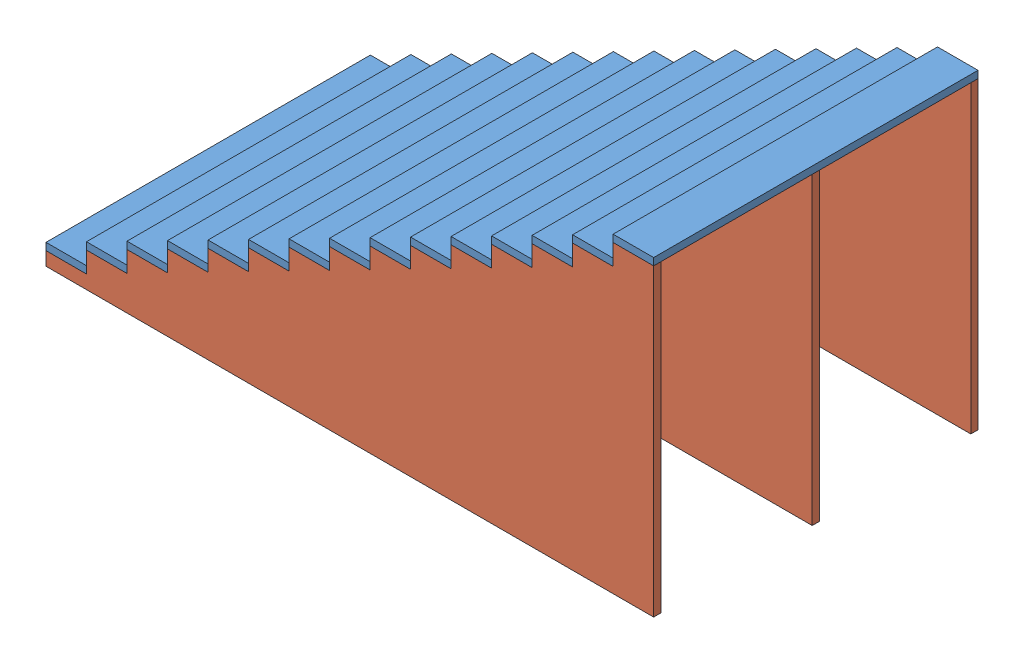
SolidWorks assembly Stair Assembly.SLDASM, configuration Default (file format 15000). Lengths in mm.
Overall size (1070.61 548.64 571.5).
18 component instances, 2 part files, 52 mates.
Components (placement in the parent):
- Stair Step-1: Stair Step.SLDPRT [Default] at (174.3811 150.6598 375.7953) x (0 0 -1) z (0 -1 0) size (571.5 71.37 12.7)
- Stair Support-1: Stair Support.SLDPRT [Default] at (281.4421 -361.4042 90.0453) size (1070.61 535.94 12.7)
- Stair Support-2: Stair Support.SLDPRT [Default] at (281.4421 -361.4042 648.8453) size (1070.61 535.94 12.7)
- Stair Step-2: Stair Step.SLDPRT [Default] at (245.7551 187.2358 375.7953) x (0 0 -1) z (0 -1 0) size (571.5 71.37 12.7)
- Stair Support-3: Stair Support.SLDPRT [Default] at (281.4421 -361.4042 369.4453) size (1070.61 535.94 12.7)
- Stair Step-3: Stair Step.SLDPRT [Default] at (103.0071 114.0838 375.7953) x (0 0 1) z (0 -1 0) size (571.5 71.37 12.7)
- Stair Step-4: Stair Step.SLDPRT [Default] at (31.6331 64.8078 375.7953) x (0 0 -1) z (0 1 0) size (571.5 71.37 12.7)
- Stair Step-5: Stair Step.SLDPRT [Default] at (-539.3589 -227.8002 375.7953) x (0 0 1) z (0 1 0) size (571.5 71.37 12.7)
- Stair Step-6: Stair Step.SLDPRT [Default] at (-111.1149 4.3558 375.7953) x (0 0 -1) z (0 -1 0) size (571.5 71.37 12.7)
- Stair Step-7: Stair Step.SLDPRT [Default] at (-182.4889 -32.2202 375.7953) x (0 0 1) z (0 -1 0) size (571.5 71.37 12.7)
- Stair Step-8: Stair Step.SLDPRT [Default] at (-253.8629 -81.4962 375.7953) x (0 0 1) z (0 1 0) size (571.5 71.37 12.7)
- Stair Step-9: Stair Step.SLDPRT [Default] at (-467.9849 -191.2242 375.7953) x (0 0 1) z (0 1 0) size (571.5 71.37 12.7)
- Stair Step-10: Stair Step.SLDPRT [Default] at (-753.4809 -337.5282 375.7953) x (0 0 1) z (0 1 0) size (571.5 71.37 12.7)
- Stair Step-11: Stair Step.SLDPRT [Default] at (-682.1069 -300.9522 375.7953) x (0 0 -1) z (0 1 0) size (571.5 71.37 12.7)
- Stair Step-12: Stair Step.SLDPRT [Default] at (-610.7329 -264.3762 375.7953) x (0 0 1) z (0 1 0) size (571.5 71.37 12.7)
- Stair Step-13: Stair Step.SLDPRT [Default] at (-396.6109 -154.6482 375.7953) x (0 0 1) z (0 1 0) size (571.5 71.37 12.7)
- Stair Step-14: Stair Step.SLDPRT [Default] at (-325.2369 -118.0722 375.7953) x (0 0 1) z (0 1 0) size (571.5 71.37 12.7)
- Stair Step-15: Stair Step.SLDPRT [Default] at (-39.7409 28.2318 375.7953) x (0 0 -1) z (0 1 0) size (571.5 71.37 12.7)
Mates (geometry in assembly coordinates):
- Coincident1: coincident anti-aligned: plane of Stair Step-1 through (174.3811 137.9598 375.7953) normal (0 -1 0); plane of Stair Support-1 through (281.4421 137.9598 102.7453) normal (0 1 0)
- Coincident2: coincident anti-aligned: plane of Stair Step-1 through (210.0681 137.9598 90.0453) normal (1 0 0); plane of Stair Support-1 through (210.0681 -361.4042 102.7453) normal (-1 0 0)
- Coincident3: coincident aligned: plane of Stair Step-1 through (210.0681 137.9598 90.0453) normal (0 0 -1); plane of Stair Support-1 through (281.4421 -361.4042 90.0453) normal (0 0 -1)
- Coincident4: coincident anti-aligned: plane of Stair Step-1 through (174.3811 137.9598 375.7953) normal (0 -1 0); plane of Stair Support-2 through (281.4421 137.9598 661.5453) normal (0 1 0)
- Coincident5: coincident anti-aligned: plane of Stair Step-1 through (210.0681 137.9598 90.0453) normal (1 0 0); plane of Stair Support-2 through (210.0681 -361.4042 661.5453) normal (-1 0 0)
- Coincident6: coincident aligned: plane of Stair Step-1 through (210.0681 137.9598 661.5453) normal (0 0 1); plane of Stair Support-2 through (281.4421 -361.4042 661.5453) normal (0 0 1)
- Coincident7: coincident anti-aligned: plane of Stair Support-1 through (281.4421 174.5358 102.7453) normal (0 1 0); plane of Stair Step-2 through (245.7551 174.5358 375.7953) normal (0 -1 0)
- Coincident8: coincident: plane of Stair Support-2 through (281.4421 -361.4042 661.5453) normal (0 0 1); line of Stair Step-2 through (281.4421 187.2358 661.5453) axis (-1 0 0)
- Coincident9: coincident aligned: plane of Stair Support-2 through (281.4421 -361.4042 661.5453) normal (1 0 0); plane of Stair Step-2 through (281.4421 174.5358 90.0453) normal (1 0 0)
- Coincident10: coincident: plane of Stair Step-1 through (174.3811 137.9598 375.7953) normal (0 -1 0); plane of Stair Support-3 through (281.4421 137.9598 380.3604) normal (0 1 0)
- Coincident11: coincident: plane of Stair Step-1 through (210.0681 137.9598 90.0453) normal (1 0 0); plane of Stair Support-3 through (210.0681 -361.4042 380.3604) normal (-1 0 0)
- Parallel2: parallel anti-aligned: plane of Stair Step-1 through (174.3811 150.6598 375.7953) normal (0 1 0); plane of Stair Step-3 through (103.0071 101.3838 375.7953) normal (0 -1 0)
- Coincident14: coincident aligned: plane of Stair Step-1 through (210.0681 137.9598 90.0453) normal (0 0 -1); plane of Stair Step-3 through (67.3201 101.3838 90.0453) normal (0 0 -1)
- Coincident16: coincident anti-aligned: plane of Stair Support-1 through (138.6941 -361.4042 102.7453) normal (-1 0 0); plane of Stair Step-3 through (138.6941 101.3838 661.5453) normal (1 0 0)
- Coincident17: coincident: line of Stair Support-1 through (138.6941 101.3838 90.0453) axis (-1 0 0); plane of Stair Step-3 through (103.0071 101.3838 375.7953) normal (0 -1 0)
- Coincident18: coincident anti-aligned: plane of Stair Support-1 through (281.4421 64.8078 102.7453) normal (0 1 0); plane of Stair Step-4 through (31.6331 64.8078 375.7953) normal (0 -1 0)
- Coincident19: coincident: plane of Stair Support-3 through (67.3201 -361.4042 380.3604) normal (-1 0 0); plane of Stair Step-4 through (67.3201 77.5078 90.0453) normal (1 0 0)
- Coincident20: coincident aligned: plane of Stair Support-2 through (281.4421 -361.4042 661.5453) normal (0 0 1); plane of Stair Step-4 through (-4.0539 77.5078 661.5453) normal (0 0 1)
- Coincident21: coincident anti-aligned: plane of Stair Support-1 through (281.4421 28.2318 102.7453) normal (0 1 0); plane of Stair Step-15 through (-39.7409 28.2318 375.7953) normal (0 -1 0)
- Coincident22: coincident anti-aligned: plane of Stair Support-2 through (-4.0539 -361.4042 661.5453) normal (-1 0 0); plane of Stair Step-15 through (-4.0539 40.9318 90.0453) normal (1 0 0)
- Coincident23: coincident aligned: plane of Stair Support-2 through (281.4421 -361.4042 661.5453) normal (0 0 1); plane of Stair Step-15 through (-75.4279 40.9318 661.5453) normal (0 0 1)
- Coincident24: coincident: plane of Stair Support-3 through (281.4421 -8.3442 380.3604) normal (0 1 0); plane of Stair Step-6 through (-111.1149 -8.3442 375.7953) normal (0 -1 0)
- Coincident26: coincident aligned: plane of Stair Support-2 through (281.4421 -361.4042 661.5453) normal (0 0 1); plane of Stair Step-6 through (-75.4279 -8.3442 661.5453) normal (0 0 1)
- Coincident27: coincident anti-aligned: plane of Stair Support-2 through (-75.4279 -361.4042 661.5453) normal (-1 0 0); plane of Stair Step-6 through (-75.4279 -8.3442 90.0453) normal (1 0 0)
- Coincident28: coincident anti-aligned: plane of Stair Support-1 through (281.4421 -44.9202 102.7453) normal (0 1 0); plane of Stair Step-7 through (-182.4889 -44.9202 375.7953) normal (0 -1 0)
- Coincident29: coincident aligned: plane of Stair Support-1 through (281.4421 -361.4042 90.0453) normal (0 0 -1); plane of Stair Step-7 through (-218.1759 -44.9202 90.0453) normal (0 0 -1)
- Coincident30: coincident anti-aligned: plane of Stair Support-1 through (-146.8019 -361.4042 102.7453) normal (-1 0 0); plane of Stair Step-7 through (-146.8019 -44.9202 661.5453) normal (1 0 0)
- Coincident31: coincident anti-aligned: plane of Stair Support-1 through (281.4421 -81.4962 102.7453) normal (0 1 0); plane of Stair Step-8 through (-253.8629 -81.4962 375.7953) normal (0 -1 0)
- Coincident32: coincident aligned: plane of Stair Support-1 through (281.4421 -361.4042 90.0453) normal (0 0 -1); plane of Stair Step-8 through (-218.1759 -68.7962 90.0453) normal (0 0 -1)
- Coincident33: coincident anti-aligned: plane of Stair Support-1 through (-218.1759 -361.4042 102.7453) normal (-1 0 0); plane of Stair Step-8 through (-218.1759 -68.7962 661.5453) normal (1 0 0)
- Coincident36: coincident anti-aligned: plane of Stair Support-1 through (281.4421 -118.0722 102.7453) normal (0 1 0); plane of Stair Step-14 through (-325.2369 -118.0722 375.7953) normal (0 -1 0)
- Coincident38: coincident aligned: plane of Stair Support-1 through (281.4421 -361.4042 90.0453) normal (0 0 -1); plane of Stair Step-14 through (-289.5499 -105.3722 90.0453) normal (0 0 -1)
- Coincident39: coincident anti-aligned: plane of Stair Support-1 through (-289.5499 -361.4042 102.7453) normal (-1 0 0); plane of Stair Step-14 through (-289.5499 -105.3722 661.5453) normal (1 0 0)
- Coincident40: coincident anti-aligned: plane of Stair Support-1 through (281.4421 -154.6482 102.7453) normal (0 1 0); plane of Stair Step-13 through (-396.6109 -154.6482 375.7953) normal (0 -1 0)
- Coincident41: coincident aligned: plane of Stair Support-1 through (281.4421 -361.4042 90.0453) normal (0 0 -1); plane of Stair Step-13 through (-360.9239 -141.9482 90.0453) normal (0 0 -1)
- Coincident42: coincident anti-aligned: plane of Stair Support-1 through (-360.9239 -361.4042 102.7453) normal (-1 0 0); plane of Stair Step-13 through (-360.9239 -141.9482 661.5453) normal (1 0 0)
- Coincident43: coincident anti-aligned: plane of Stair Support-1 through (281.4421 -191.2242 102.7453) normal (0 1 0); plane of Stair Step-9 through (-467.9849 -191.2242 375.7953) normal (0 -1 0)
- Coincident44: coincident aligned: plane of Stair Support-1 through (281.4421 -361.4042 90.0453) normal (0 0 -1); plane of Stair Step-9 through (-432.2979 -178.5242 90.0453) normal (0 0 -1)
- Coincident45: coincident anti-aligned: plane of Stair Support-1 through (-432.2979 -361.4042 102.7453) normal (-1 0 0); plane of Stair Step-9 through (-432.2979 -178.5242 661.5453) normal (1 0 0)
- Coincident46: coincident anti-aligned: plane of Stair Support-1 through (281.4421 -227.8002 102.7453) normal (0 1 0); plane of Stair Step-5 through (-539.3589 -227.8002 375.7953) normal (0 -1 0)
- Coincident47: coincident aligned: plane of Stair Support-1 through (281.4421 -361.4042 90.0453) normal (0 0 -1); plane of Stair Step-5 through (-503.6719 -215.1002 90.0453) normal (0 0 -1)
- Coincident48: coincident: plane of Stair Support-1 through (-503.6719 -361.4042 102.7453) normal (-1 0 0); line of Stair Step-5 through (-503.6719 -215.1002 661.5453) axis (0 0 -1)
- Coincident49: coincident anti-aligned: plane of Stair Support-1 through (281.4421 -264.3762 102.7453) normal (0 1 0); plane of Stair Step-12 through (-610.7329 -264.3762 375.7953) normal (0 -1 0)
- Coincident50: coincident aligned: plane of Stair Support-1 through (281.4421 -361.4042 90.0453) normal (0 0 -1); plane of Stair Step-12 through (-575.0459 -251.6762 90.0453) normal (0 0 -1)
- Coincident51: coincident: plane of Stair Support-1 through (-575.0459 -361.4042 102.7453) normal (-1 0 0); line of Stair Step-12 through (-575.0459 -251.6762 661.5453) axis (0 0 -1)
- Coincident52: coincident anti-aligned: plane of Stair Support-1 through (281.4421 -300.9522 102.7453) normal (0 1 0); plane of Stair Step-11 through (-682.1069 -300.9522 375.7953) normal (0 -1 0)
- Coincident53: coincident aligned: plane of Stair Support-1 through (281.4421 -361.4042 90.0453) normal (0 0 -1); plane of Stair Step-11 through (-717.7939 -288.2522 90.0453) normal (0 0 -1)
- Coincident54: coincident anti-aligned: plane of Stair Support-1 through (-646.4199 -361.4042 102.7453) normal (-1 0 0); plane of Stair Step-11 through (-646.4199 -288.2522 90.0453) normal (1 0 0)
- Coincident55: coincident anti-aligned: plane of Stair Support-1 through (281.4421 -337.5282 102.7453) normal (0 1 0); plane of Stair Step-10 through (-753.4809 -337.5282 375.7953) normal (0 -1 0)
- Coincident56: coincident aligned: plane of Stair Support-1 through (281.4421 -361.4042 90.0453) normal (0 0 -1); plane of Stair Step-10 through (-717.7939 -324.8282 90.0453) normal (0 0 -1)
- Coincident57: coincident anti-aligned: plane of Stair Support-1 through (-717.7939 -361.4042 102.7453) normal (-1 0 0); plane of Stair Step-10 through (-717.7939 -324.8282 661.5453) normal (1 0 0)
- Coincident58: coincident: line of Stair Support-3 through (-646.4199 -264.3762 375.7953) axis (1 0 0)
